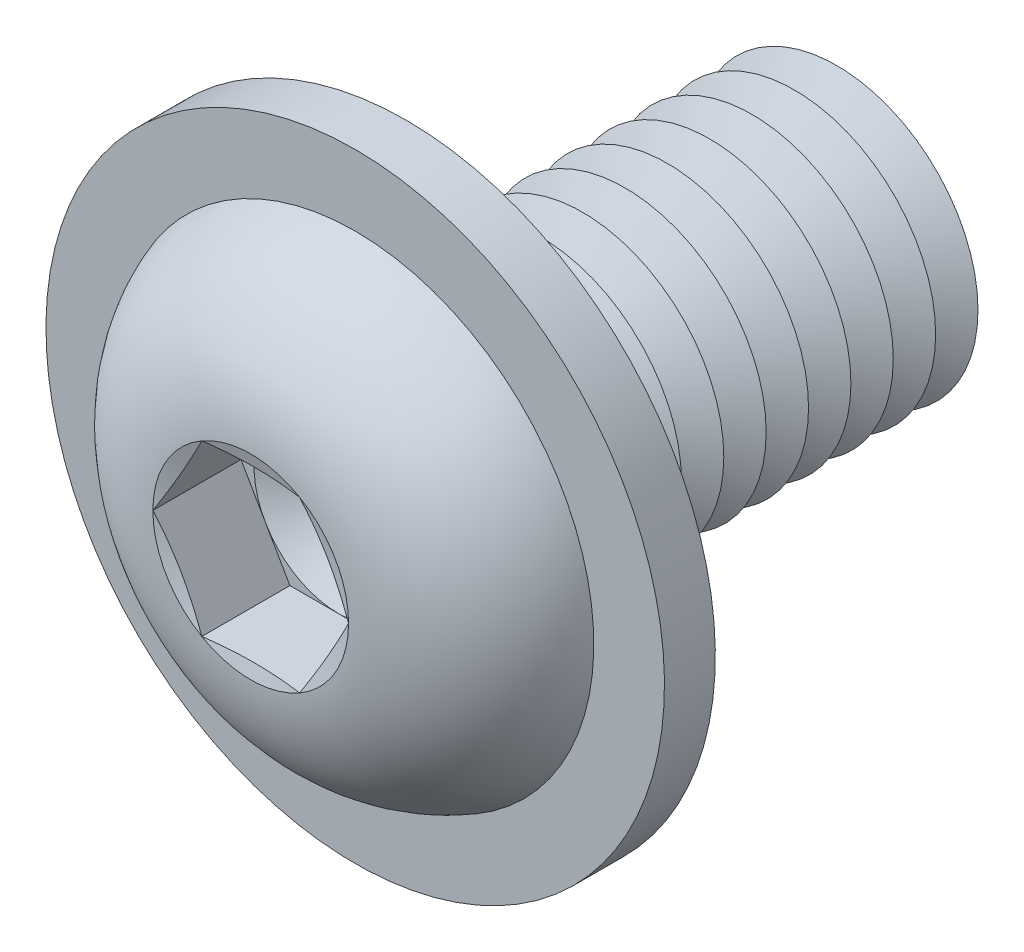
from build123d import *

# Parameters (mm, degrees)
FILLET1_R           = 0.75
LPATTERN1_COUNT     = 10
LPATTERN1_PITCH     = 1.5
CUT_EXTRUDE1_DEPTH  = 3.12
SKETCH5_R           = 10.95
SKETCH5_R_2         = 5.75
BOSS_EXTRUDE1_DEPTH = 1.8


with BuildPart() as part:
    # Sketch1 → Revolve1 (revolve)
    with BuildSketch(Plane(origin=(0, 0, 0), x_dir=(0, 0, -1), z_dir=(1, 0, 0)), mode=Mode.PRIVATE) as revolve1_sk:
        with BuildLine():
            Line((0, 5), (0, 8.75))
            ThreePointArc((0, 8.75), (-3.814142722, 7.21429474), (-5.5, 3.4641))
            Line((-5.5, 3.4641), (-5.035898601, 1.73205))
            Line((-5.035898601, 1.73205), (-5.5, 1.73205))
            Line((-5.5, 1.73205), (-5.5, 0))
            Line((-5.5, 0), (16, 0))
            Line((16, 0), (16, 5))
            Line((16, 5), (0, 5))
        make_face()
    revolve(revolve1_sk.sketch.rotate(Axis((0, 0, -16), (0, 0, 1)), 90), axis=Axis((0, 0, -16), (0, 0, 1)))

    # Fillet1
    fillet1_edges = [part.edges().sort_by_distance(p)[0] for p in [
        (5, 0, 0),
    ]]
    fillet(fillet1_edges, radius=FILLET1_R)

    # Sketch2 → Cut-Revolve1 (revolve, cut)
    with BuildSketch(Plane(origin=(0, 0, 0), x_dir=(0, 0, -1), z_dir=(1, 0, 0)), mode=Mode.PRIVATE) as cut_revolve1_sk:
        Polygon((15.25, 5), (16.75, 5), (16, 3.700961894), align=None)
    cut_revolve1 = revolve(cut_revolve1_sk.sketch.rotate(Axis((0, 0, -16), (0, 0, -1)), 270), axis=Axis((0, 0, -16), (0, 0, -1)), mode=Mode.SUBTRACT)

    # LPattern1: Cut-Revolve1 ×10
    with Locations(*[(0, 0, i * LPATTERN1_PITCH) for i in range(1, LPATTERN1_COUNT)]):
        add(cut_revolve1, mode=Mode.SUBTRACT)

    # Sketch3 → Cut-Extrude1 (cut)
    with BuildSketch(Plane.XY.offset(5.5)):
        Polygon((1.73205, 2.999998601), (-1.73205, 2.999998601), (-3.4641, 0), (-1.73205, -2.999998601), (1.73205, -2.999998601), (3.4641, 0), align=None)
    extrude(amount=-CUT_EXTRUDE1_DEPTH, mode=Mode.SUBTRACT)

    # Cut-Extrude2 cone 1 section (on through the dimple's axis) → Cut-Extrude2 (revolve, cut)
    with BuildSketch(Plane(origin=(0, 0, 2.38), x_dir=(0, -1, 0), z_dir=(1, 0, 0))):
        Polygon((0, 0), (2.999998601, 0), (0, 1.73205), align=None)
    revolve(axis=Axis((0, 0, 2.38), (0, 0, -1)), mode=Mode.SUBTRACT)

    # Sketch5 → Boss-Extrude1 (add)
    with BuildSketch(Plane(origin=(0, 0, 0), x_dir=(-1, 0, 0), z_dir=(0, 0, -1))):
        with Locations(Location((0, 0, 0), (0, 0, 90))):
            Circle(SKETCH5_R)
        Circle(SKETCH5_R_2, mode=Mode.SUBTRACT)
    extrude(amount=-BOSS_EXTRUDE1_DEPTH)


solid = part.part
